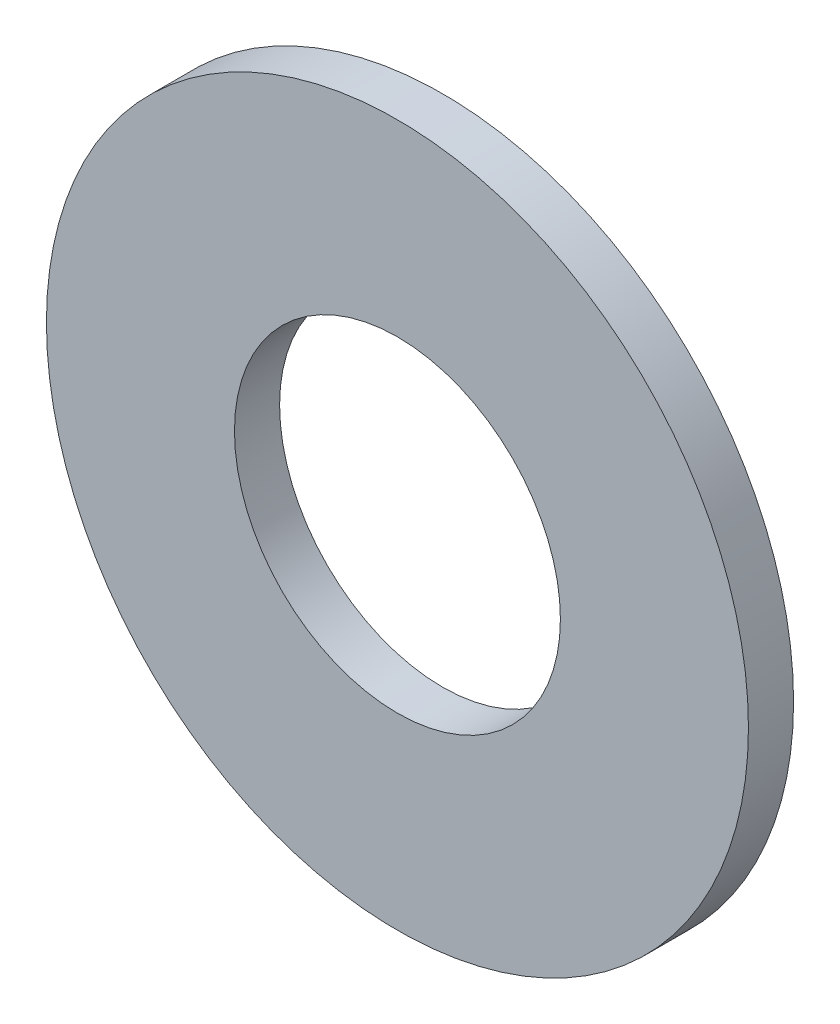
ISO-10303-21;
HEADER;
FILE_DESCRIPTION(('STEP AP214'),'2;1');
FILE_NAME('part.step','',(''),(''),'','','');
FILE_SCHEMA(('AUTOMOTIVE_DESIGN { 1 0 10303 214 1 1 1 1 }'));
ENDSEC;
DATA;
#1=APPLICATION_CONTEXT('core data for automotive mechanical design processes');
#2=APPLICATION_PROTOCOL_DEFINITION('international standard','automotive_design',2000,#1);
#3=PRODUCT_CONTEXT('',#1,'mechanical');
#4=PRODUCT('Part','Part','',(#3));
#5=PRODUCT_RELATED_PRODUCT_CATEGORY('part','',(#4));
#6=PRODUCT_DEFINITION_FORMATION('','',#4);
#7=PRODUCT_DEFINITION_CONTEXT('part definition',#1,'design');
#8=PRODUCT_DEFINITION('design','',#6,#7);
#9=PRODUCT_DEFINITION_SHAPE('','',#8);
#10=(LENGTH_UNIT() NAMED_UNIT(*) SI_UNIT(.MILLI.,.METRE.));
#11=(NAMED_UNIT(*) PLANE_ANGLE_UNIT() SI_UNIT($,.RADIAN.));
#12=(NAMED_UNIT(*) SI_UNIT($,.STERADIAN.) SOLID_ANGLE_UNIT());
#13=UNCERTAINTY_MEASURE_WITH_UNIT(LENGTH_MEASURE(1.E-05),#10,'distance_accuracy_value','');
#14=(GEOMETRIC_REPRESENTATION_CONTEXT(3) GLOBAL_UNCERTAINTY_ASSIGNED_CONTEXT((#13)) GLOBAL_UNIT_ASSIGNED_CONTEXT((#10,
#11,#12)) REPRESENTATION_CONTEXT('',''));
#15=CARTESIAN_POINT('',(0.,0.,0.));
#16=DIRECTION('',(0.,0.,1.));
#17=DIRECTION('',(1.,0.,0.));
#18=AXIS2_PLACEMENT_3D('',#15,#16,#17);
#19=CARTESIAN_POINT('',(0.,0.,0.9));
#20=DIRECTION('',(0.,0.,1.));
#21=DIRECTION('',(1.,0.,0.));
#22=AXIS2_PLACEMENT_3D('',#19,#20,#21);
#23=PLANE('',#22);
#24=CARTESIAN_POINT('',(0.,0.,0.9));
#25=DIRECTION('',(0.,0.,1.));
#26=DIRECTION('',(1.,0.,0.));
#27=AXIS2_PLACEMENT_3D('',#24,#25,#26);
#28=CIRCLE('',#27,7.);
#29=CARTESIAN_POINT('',(7.,0.,0.9));
#30=VERTEX_POINT('',#29);
#31=EDGE_CURVE('E10',#30,#30,#28,.T.);
#32=ORIENTED_EDGE('',*,*,#31,.T.);
#33=EDGE_LOOP('',(#32));
#34=FACE_BOUND('',#33,.T.);
#35=CARTESIAN_POINT('',(0.,0.,0.9));
#36=DIRECTION('',(0.,0.,1.));
#37=DIRECTION('',(1.,0.,0.));
#38=AXIS2_PLACEMENT_3D('',#35,#36,#37);
#39=CIRCLE('',#38,3.25);
#40=CARTESIAN_POINT('',(3.25,0.,0.9));
#41=VERTEX_POINT('',#40);
#42=EDGE_CURVE('E27',#41,#41,#39,.T.);
#43=ORIENTED_EDGE('',*,*,#42,.F.);
#44=EDGE_LOOP('',(#43));
#45=FACE_BOUND('',#44,.T.);
#46=ADVANCED_FACE('F16',(#34,#45),#23,.T.);
#47=CARTESIAN_POINT('',(0.,0.,0.));
#48=DIRECTION('',(0.,0.,1.));
#49=DIRECTION('',(1.,0.,0.));
#50=AXIS2_PLACEMENT_3D('',#47,#48,#49);
#51=PLANE('',#50);
#52=CARTESIAN_POINT('',(0.,0.,0.));
#53=DIRECTION('',(0.,0.,1.));
#54=DIRECTION('',(1.,0.,0.));
#55=AXIS2_PLACEMENT_3D('',#52,#53,#54);
#56=CIRCLE('',#55,7.);
#57=CARTESIAN_POINT('',(7.,0.,0.));
#58=VERTEX_POINT('',#57);
#59=EDGE_CURVE('E20',#58,#58,#56,.T.);
#60=ORIENTED_EDGE('',*,*,#59,.F.);
#61=EDGE_LOOP('',(#60));
#62=FACE_BOUND('',#61,.T.);
#63=CARTESIAN_POINT('',(0.,0.,0.));
#64=DIRECTION('',(0.,0.,1.));
#65=DIRECTION('',(1.,0.,0.));
#66=AXIS2_PLACEMENT_3D('',#63,#64,#65);
#67=CIRCLE('',#66,3.25);
#68=CARTESIAN_POINT('',(3.25,0.,0.));
#69=VERTEX_POINT('',#68);
#70=EDGE_CURVE('E29',#69,#69,#67,.T.);
#71=ORIENTED_EDGE('',*,*,#70,.T.);
#72=EDGE_LOOP('',(#71));
#73=FACE_BOUND('',#72,.T.);
#74=ADVANCED_FACE('F39',(#62,#73),#51,.F.);
#75=CARTESIAN_POINT('',(0.,0.,0.9));
#76=DIRECTION('',(0.,0.,-1.));
#77=DIRECTION('',(-1.,0.,0.));
#78=AXIS2_PLACEMENT_3D('',#75,#76,#77);
#79=CYLINDRICAL_SURFACE('',#78,7.);
#80=ORIENTED_EDGE('',*,*,#31,.F.);
#81=EDGE_LOOP('',(#80));
#82=FACE_BOUND('',#81,.T.);
#83=ORIENTED_EDGE('',*,*,#59,.T.);
#84=EDGE_LOOP('',(#83));
#85=FACE_BOUND('',#84,.T.);
#86=ADVANCED_FACE('F18',(#82,#85),#79,.T.);
#87=CARTESIAN_POINT('',(0.,0.,0.9));
#88=DIRECTION('',(0.,0.,-1.));
#89=DIRECTION('',(-1.,0.,0.));
#90=AXIS2_PLACEMENT_3D('',#87,#88,#89);
#91=CYLINDRICAL_SURFACE('',#90,3.25);
#92=ORIENTED_EDGE('',*,*,#42,.T.);
#93=EDGE_LOOP('',(#92));
#94=FACE_BOUND('',#93,.T.);
#95=ORIENTED_EDGE('',*,*,#70,.F.);
#96=EDGE_LOOP('',(#95));
#97=FACE_BOUND('',#96,.T.);
#98=ADVANCED_FACE('F35',(#94,#97),#91,.F.);
#99=CLOSED_SHELL('',(#46,#74,#86,#98));
#100=MANIFOLD_SOLID_BREP('B1',#99);
#101=ADVANCED_BREP_SHAPE_REPRESENTATION('',(#18,#100),#14);
#102=SHAPE_DEFINITION_REPRESENTATION(#9,#101);
ENDSEC;
END-ISO-10303-21;
